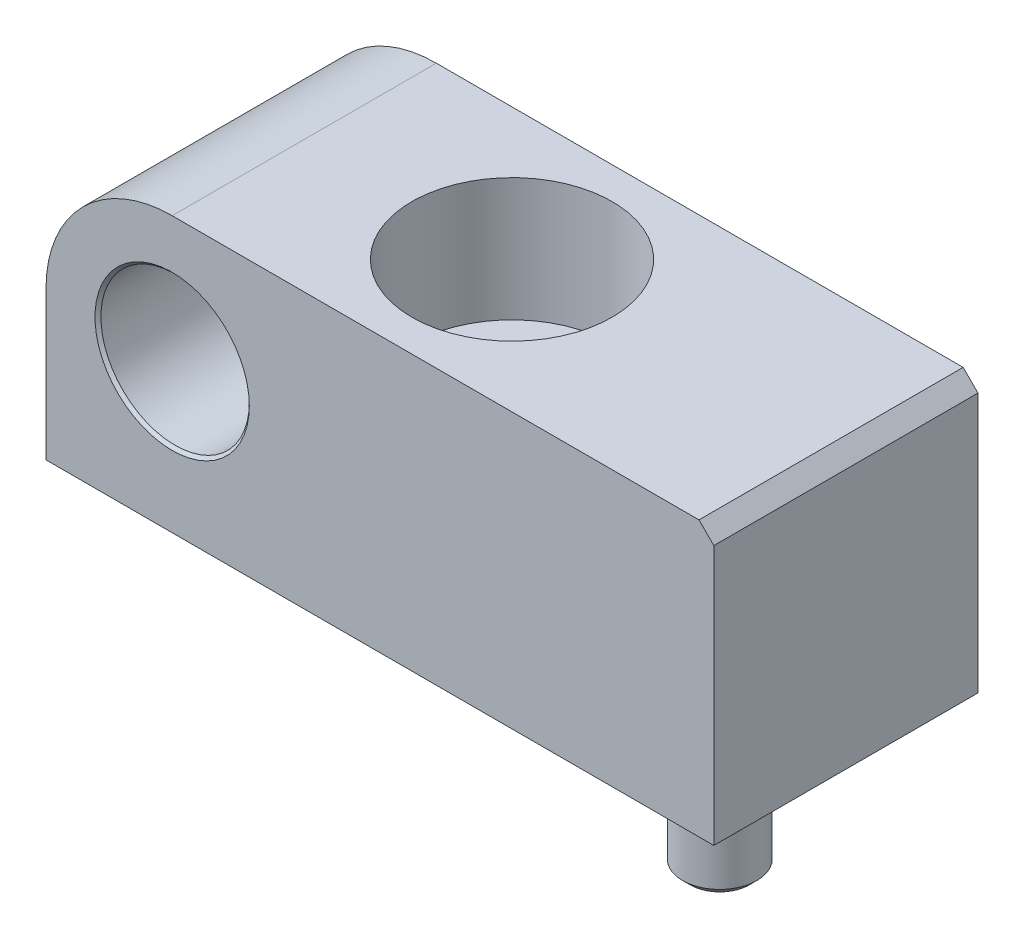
ISO-10303-21;
HEADER;
FILE_DESCRIPTION(('STEP AP214'),'2;1');
FILE_NAME('part.step','',(''),(''),'','','');
FILE_SCHEMA(('AUTOMOTIVE_DESIGN { 1 0 10303 214 1 1 1 1 }'));
ENDSEC;
DATA;
#1=APPLICATION_CONTEXT('core data for automotive mechanical design processes');
#2=APPLICATION_PROTOCOL_DEFINITION('international standard','automotive_design',2000,#1);
#3=PRODUCT_CONTEXT('',#1,'mechanical');
#4=PRODUCT('Part','Part','',(#3));
#5=PRODUCT_RELATED_PRODUCT_CATEGORY('part','',(#4));
#6=PRODUCT_DEFINITION_FORMATION('','',#4);
#7=PRODUCT_DEFINITION_CONTEXT('part definition',#1,'design');
#8=PRODUCT_DEFINITION('design','',#6,#7);
#9=PRODUCT_DEFINITION_SHAPE('','',#8);
#10=(LENGTH_UNIT() NAMED_UNIT(*) SI_UNIT(.MILLI.,.METRE.));
#11=(NAMED_UNIT(*) PLANE_ANGLE_UNIT() SI_UNIT($,.RADIAN.));
#12=(NAMED_UNIT(*) SI_UNIT($,.STERADIAN.) SOLID_ANGLE_UNIT());
#13=UNCERTAINTY_MEASURE_WITH_UNIT(LENGTH_MEASURE(1.E-05),#10,'distance_accuracy_value','');
#14=(GEOMETRIC_REPRESENTATION_CONTEXT(3) GLOBAL_UNCERTAINTY_ASSIGNED_CONTEXT((#13)) GLOBAL_UNIT_ASSIGNED_CONTEXT((#10,
#11,#12)) REPRESENTATION_CONTEXT('',''));
#15=CARTESIAN_POINT('',(0.,0.,0.));
#16=DIRECTION('',(0.,0.,1.));
#17=DIRECTION('',(1.,0.,0.));
#18=AXIS2_PLACEMENT_3D('',#15,#16,#17);
#19=CARTESIAN_POINT('',(0.,10.,0.));
#20=DIRECTION('',(0.,-1.,0.));
#21=DIRECTION('',(0.,0.,-1.));
#22=AXIS2_PLACEMENT_3D('',#19,#20,#21);
#23=PLANE('',#22);
#24=CARTESIAN_POINT('',(0.,10.,0.));
#25=DIRECTION('',(0.,-1.,0.));
#26=DIRECTION('',(0.,0.,-1.));
#27=AXIS2_PLACEMENT_3D('',#24,#25,#26);
#28=CIRCLE('',#27,2.5);
#29=CARTESIAN_POINT('',(0.,10.,-2.5));
#30=VERTEX_POINT('',#29);
#31=EDGE_CURVE('P0_E165',#30,#30,#28,.T.);
#32=ORIENTED_EDGE('',*,*,#31,.T.);
#33=EDGE_LOOP('',(#32));
#34=FACE_BOUND('',#33,.T.);
#35=ADVANCED_FACE('P0_F16',(#34),#23,.T.);
#36=CARTESIAN_POINT('',(-13.9999765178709,10.1999962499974,0.));
#37=DIRECTION('',(0.,1.,0.));
#38=DIRECTION('',(0.,0.,1.));
#39=AXIS2_PLACEMENT_3D('',#36,#37,#38);
#40=PLANE('',#39);
#41=CARTESIAN_POINT('',(-13.9999765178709,10.1999962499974,0.));
#42=DIRECTION('',(0.,1.,0.));
#43=DIRECTION('',(0.,0.,1.));
#44=AXIS2_PLACEMENT_3D('',#41,#42,#43);
#45=CIRCLE('',#44,6.75);
#46=CARTESIAN_POINT('',(-13.9999765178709,10.1999962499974,6.75));
#47=VERTEX_POINT('',#46);
#48=EDGE_CURVE('P0_E19',#47,#47,#45,.T.);
#49=ORIENTED_EDGE('',*,*,#48,.T.);
#50=EDGE_LOOP('',(#49));
#51=FACE_BOUND('',#50,.T.);
#52=CARTESIAN_POINT('',(-13.9999765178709,10.1999962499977,0.));
#53=DIRECTION('',(0.,1.,0.));
#54=DIRECTION('',(0.,0.,1.));
#55=AXIS2_PLACEMENT_3D('',#52,#53,#54);
#56=CIRCLE('',#55,4.2);
#57=CARTESIAN_POINT('',(-13.9999765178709,10.1999962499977,4.2));
#58=VERTEX_POINT('',#57);
#59=EDGE_CURVE('P0_E163',#58,#58,#56,.F.);
#60=ORIENTED_EDGE('',*,*,#59,.T.);
#61=EDGE_LOOP('',(#60));
#62=FACE_BOUND('',#61,.T.);
#63=ADVANCED_FACE('P0_F172',(#51,#62),#40,.T.);
#64=CARTESIAN_POINT('',(-28.,9.99999999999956,-8.89999999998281));
#65=DIRECTION('',(0.,0.,-1.));
#66=DIRECTION('',(-1.,0.,0.));
#67=AXIS2_PLACEMENT_3D('',#64,#65,#66);
#68=CONICAL_SURFACE('',#67,5.19999999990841,0.785398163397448);
#69=CARTESIAN_POINT('',(-28.,9.99999999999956,-8.70000000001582));
#70=DIRECTION('',(0.,0.,1.));
#71=DIRECTION('',(1.,0.,0.));
#72=AXIS2_PLACEMENT_3D('',#69,#70,#71);
#73=CIRCLE('',#72,5.);
#74=CARTESIAN_POINT('',(-23.,9.99999999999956,-8.70000000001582));
#75=VERTEX_POINT('',#74);
#76=EDGE_CURVE('P0_E147',#75,#75,#73,.T.);
#77=ORIENTED_EDGE('',*,*,#76,.T.);
#78=EDGE_LOOP('',(#77));
#79=FACE_BOUND('',#78,.T.);
#80=CARTESIAN_POINT('',(-28.,9.99999999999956,-8.90000000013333));
#81=DIRECTION('',(0.,0.,-1.));
#82=DIRECTION('',(-1.,0.,0.));
#83=AXIS2_PLACEMENT_3D('',#80,#81,#82);
#84=CIRCLE('',#83,5.20000000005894);
#85=CARTESIAN_POINT('',(-33.2000000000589,9.99999999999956,-8.90000000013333));
#86=VERTEX_POINT('',#85);
#87=EDGE_CURVE('P0_E125',#86,#86,#84,.T.);
#88=ORIENTED_EDGE('',*,*,#87,.T.);
#89=EDGE_LOOP('',(#88));
#90=FACE_BOUND('',#89,.T.);
#91=ADVANCED_FACE('P0_F307',(#79,#90),#68,.F.);
#92=CARTESIAN_POINT('',(-28.,9.99999999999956,-8.9));
#93=DIRECTION('',(0.,0.,1.));
#94=DIRECTION('',(1.,0.,0.));
#95=AXIS2_PLACEMENT_3D('',#92,#93,#94);
#96=CYLINDRICAL_SURFACE('',#95,5.);
#97=ORIENTED_EDGE('',*,*,#76,.F.);
#98=EDGE_LOOP('',(#97));
#99=FACE_BOUND('',#98,.T.);
#100=CARTESIAN_POINT('',(-28.,9.99999999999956,8.69999999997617));
#101=DIRECTION('',(0.,0.,1.));
#102=DIRECTION('',(1.,0.,0.));
#103=AXIS2_PLACEMENT_3D('',#100,#101,#102);
#104=CIRCLE('',#103,5.00000000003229);
#105=CARTESIAN_POINT('',(-22.9999999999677,9.99999999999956,8.69999999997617));
#106=VERTEX_POINT('',#105);
#107=EDGE_CURVE('P0_E129',#106,#106,#104,.T.);
#108=ORIENTED_EDGE('',*,*,#107,.T.);
#109=EDGE_LOOP('',(#108));
#110=FACE_BOUND('',#109,.T.);
#111=ADVANCED_FACE('P0_F179',(#99,#110),#96,.F.);
#112=CARTESIAN_POINT('',(-13.9999765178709,10.1999962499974,0.));
#113=DIRECTION('',(0.,1.,0.));
#114=DIRECTION('',(0.,0.,1.));
#115=AXIS2_PLACEMENT_3D('',#112,#113,#114);
#116=CYLINDRICAL_SURFACE('',#115,6.75);
#117=ORIENTED_EDGE('',*,*,#48,.F.);
#118=EDGE_LOOP('',(#117));
#119=FACE_BOUND('',#118,.T.);
#120=CARTESIAN_POINT('',(-13.9999765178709,18.4999962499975,0.));
#121=DIRECTION('',(0.,1.,0.));
#122=DIRECTION('',(0.,0.,1.));
#123=AXIS2_PLACEMENT_3D('',#120,#121,#122);
#124=CIRCLE('',#123,6.75);
#125=CARTESIAN_POINT('',(-13.9999765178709,18.4999962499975,6.75));
#126=VERTEX_POINT('',#125);
#127=EDGE_CURVE('P0_E111',#126,#126,#124,.F.);
#128=ORIENTED_EDGE('',*,*,#127,.F.);
#129=EDGE_LOOP('',(#128));
#130=FACE_BOUND('',#129,.T.);
#131=ADVANCED_FACE('P0_F175',(#119,#130),#116,.F.);
#132=CARTESIAN_POINT('',(0.,10.,0.));
#133=DIRECTION('',(0.,-1.,0.));
#134=DIRECTION('',(0.,0.,-1.));
#135=AXIS2_PLACEMENT_3D('',#132,#133,#134);
#136=CYLINDRICAL_SURFACE('',#135,2.5);
#137=ORIENTED_EDGE('',*,*,#31,.F.);
#138=EDGE_LOOP('',(#137));
#139=FACE_BOUND('',#138,.T.);
#140=CARTESIAN_POINT('',(0.,0.,0.));
#141=DIRECTION('',(0.,-1.,0.));
#142=DIRECTION('',(0.,0.,-1.));
#143=AXIS2_PLACEMENT_3D('',#140,#141,#142);
#144=CIRCLE('',#143,2.5);
#145=CARTESIAN_POINT('',(0.,0.,-2.5));
#146=VERTEX_POINT('',#145);
#147=EDGE_CURVE('P0_E89',#146,#146,#144,.F.);
#148=ORIENTED_EDGE('',*,*,#147,.F.);
#149=EDGE_LOOP('',(#148));
#150=FACE_BOUND('',#149,.T.);
#151=ADVANCED_FACE('P0_F178',(#139,#150),#136,.F.);
#152=CARTESIAN_POINT('',(-13.9999765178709,0.,0.));
#153=DIRECTION('',(0.,1.,0.));
#154=DIRECTION('',(0.,0.,1.));
#155=AXIS2_PLACEMENT_3D('',#152,#153,#154);
#156=CYLINDRICAL_SURFACE('',#155,4.2);
#157=ORIENTED_EDGE('',*,*,#59,.F.);
#158=EDGE_LOOP('',(#157));
#159=FACE_BOUND('',#158,.T.);
#160=CARTESIAN_POINT('',(-13.9999765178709,0.,0.));
#161=DIRECTION('',(0.,1.,0.));
#162=DIRECTION('',(0.,0.,1.));
#163=AXIS2_PLACEMENT_3D('',#160,#161,#162);
#164=CIRCLE('',#163,4.2);
#165=CARTESIAN_POINT('',(-13.9999765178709,0.,4.2));
#166=VERTEX_POINT('',#165);
#167=EDGE_CURVE('P0_E105',#166,#166,#164,.T.);
#168=ORIENTED_EDGE('',*,*,#167,.F.);
#169=EDGE_LOOP('',(#168));
#170=FACE_BOUND('',#169,.T.);
#171=ADVANCED_FACE('P0_F273',(#159,#170),#156,.F.);
#172=CARTESIAN_POINT('',(-28.,9.99999999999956,-8.9));
#173=DIRECTION('',(0.,0.,1.));
#174=DIRECTION('',(1.,0.,0.));
#175=AXIS2_PLACEMENT_3D('',#172,#173,#174);
#176=PLANE('',#175);
#177=DIRECTION('',(1.,0.,0.));
#178=VECTOR('',#177,1.);
#179=CARTESIAN_POINT('',(-28.,18.4999962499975,-8.9));
#180=LINE('',#179,#178);
#181=CARTESIAN_POINT('',(7.50002348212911,18.4999962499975,-8.9));
#182=VERTEX_POINT('',#181);
#183=CARTESIAN_POINT('',(-28.,18.4999962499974,-8.9));
#184=VERTEX_POINT('',#183);
#185=EDGE_CURVE('P0_E66',#182,#184,#180,.F.);
#186=ORIENTED_EDGE('',*,*,#185,.F.);
#187=DIRECTION('',(-0.707106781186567,0.707106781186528,0.));
#188=VECTOR('',#187,1.);
#189=CARTESIAN_POINT('',(7.50002348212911,18.4999962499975,-8.9));
#190=LINE('',#189,#188);
#191=CARTESIAN_POINT('',(8.50002348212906,17.4999962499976,-8.9));
#192=VERTEX_POINT('',#191);
#193=EDGE_CURVE('P0_E124',#192,#182,#190,.T.);
#194=ORIENTED_EDGE('',*,*,#193,.F.);
#195=DIRECTION('',(0.,1.,0.));
#196=VECTOR('',#195,1.);
#197=CARTESIAN_POINT('',(8.50002348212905,0.,-8.9));
#198=LINE('',#197,#196);
#199=CARTESIAN_POINT('',(8.50002348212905,0.,-8.9));
#200=VERTEX_POINT('',#199);
#201=EDGE_CURVE('P0_E138',#200,#192,#198,.T.);
#202=ORIENTED_EDGE('',*,*,#201,.F.);
#203=DIRECTION('',(1.,0.,0.));
#204=VECTOR('',#203,1.);
#205=CARTESIAN_POINT('',(8.50002348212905,0.,-8.9));
#206=LINE('',#205,#204);
#207=CARTESIAN_POINT('',(-36.4999962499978,0.,-8.9));
#208=VERTEX_POINT('',#207);
#209=EDGE_CURVE('P0_E86',#208,#200,#206,.T.);
#210=ORIENTED_EDGE('',*,*,#209,.F.);
#211=DIRECTION('',(0.,1.,0.));
#212=VECTOR('',#211,1.);
#213=CARTESIAN_POINT('',(-36.4999962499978,0.,-8.9));
#214=LINE('',#213,#212);
#215=CARTESIAN_POINT('',(-36.4999962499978,9.99999999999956,-8.9));
#216=VERTEX_POINT('',#215);
#217=EDGE_CURVE('P0_E82',#216,#208,#214,.F.);
#218=ORIENTED_EDGE('',*,*,#217,.F.);
#219=CARTESIAN_POINT('',(-28.,9.99999999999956,-8.9));
#220=DIRECTION('',(0.,0.,1.));
#221=DIRECTION('',(1.,0.,0.));
#222=AXIS2_PLACEMENT_3D('',#219,#220,#221);
#223=CIRCLE('',#222,8.49999624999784);
#224=EDGE_CURVE('P0_E71',#184,#216,#223,.T.);
#225=ORIENTED_EDGE('',*,*,#224,.F.);
#226=EDGE_LOOP('',(#186,#194,#202,#210,#218,#225));
#227=FACE_BOUND('',#226,.T.);
#228=ORIENTED_EDGE('',*,*,#87,.F.);
#229=EDGE_LOOP('',(#228));
#230=FACE_BOUND('',#229,.T.);
#231=ADVANCED_FACE('P0_F83',(#227,#230),#176,.F.);
#232=CARTESIAN_POINT('',(7.50002348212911,18.4999962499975,-8.9));
#233=DIRECTION('',(0.707106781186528,0.707106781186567,0.));
#234=DIRECTION('',(-0.707106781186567,0.707106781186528,0.));
#235=AXIS2_PLACEMENT_3D('',#232,#233,#234);
#236=PLANE('',#235);
#237=ORIENTED_EDGE('',*,*,#193,.T.);
#238=DIRECTION('',(0.,0.,1.));
#239=VECTOR('',#238,1.);
#240=CARTESIAN_POINT('',(7.50002348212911,18.4999962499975,-8.9));
#241=LINE('',#240,#239);
#242=CARTESIAN_POINT('',(7.50002348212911,18.4999962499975,8.9));
#243=VERTEX_POINT('',#242);
#244=EDGE_CURVE('P0_E109',#243,#182,#241,.F.);
#245=ORIENTED_EDGE('',*,*,#244,.F.);
#246=DIRECTION('',(-0.707106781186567,0.707106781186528,0.));
#247=VECTOR('',#246,1.);
#248=CARTESIAN_POINT('',(7.50002348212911,18.4999962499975,8.9));
#249=LINE('',#248,#247);
#250=CARTESIAN_POINT('',(8.50002348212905,17.4999962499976,8.9));
#251=VERTEX_POINT('',#250);
#252=EDGE_CURVE('P0_E122',#243,#251,#249,.F.);
#253=ORIENTED_EDGE('',*,*,#252,.T.);
#254=DIRECTION('',(0.,0.,-1.));
#255=VECTOR('',#254,1.);
#256=CARTESIAN_POINT('',(8.50002348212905,17.4999962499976,-8.9));
#257=LINE('',#256,#255);
#258=EDGE_CURVE('P0_E134',#192,#251,#257,.F.);
#259=ORIENTED_EDGE('',*,*,#258,.F.);
#260=EDGE_LOOP('',(#237,#245,#253,#259));
#261=FACE_BOUND('',#260,.T.);
#262=ADVANCED_FACE('P0_F193',(#261),#236,.T.);
#263=CARTESIAN_POINT('',(-28.,9.99999999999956,8.89999999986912));
#264=DIRECTION('',(0.,0.,1.));
#265=DIRECTION('',(1.,0.,0.));
#266=AXIS2_PLACEMENT_3D('',#263,#264,#265);
#267=CONICAL_SURFACE('',#266,5.19999999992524,0.785398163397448);
#268=ORIENTED_EDGE('',*,*,#107,.F.);
#269=EDGE_LOOP('',(#268));
#270=FACE_BOUND('',#269,.T.);
#271=CARTESIAN_POINT('',(-28.,9.99999999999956,8.89999999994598));
#272=DIRECTION('',(0.,0.,1.));
#273=DIRECTION('',(1.,0.,0.));
#274=AXIS2_PLACEMENT_3D('',#271,#272,#273);
#275=CIRCLE('',#274,5.20000000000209);
#276=CARTESIAN_POINT('',(-22.7999999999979,9.99999999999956,8.89999999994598));
#277=VERTEX_POINT('',#276);
#278=EDGE_CURVE('P0_E137',#277,#277,#275,.F.);
#279=ORIENTED_EDGE('',*,*,#278,.F.);
#280=EDGE_LOOP('',(#279));
#281=FACE_BOUND('',#280,.T.);
#282=ADVANCED_FACE('P0_F185',(#270,#281),#267,.F.);
#283=CARTESIAN_POINT('',(-28.,18.4999962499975,-8.9));
#284=DIRECTION('',(0.,1.,0.));
#285=DIRECTION('',(0.,0.,1.));
#286=AXIS2_PLACEMENT_3D('',#283,#284,#285);
#287=PLANE('',#286);
#288=ORIENTED_EDGE('',*,*,#185,.T.);
#289=DIRECTION('',(0.,0.,1.));
#290=VECTOR('',#289,1.);
#291=CARTESIAN_POINT('',(-28.,18.4999962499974,-8.9));
#292=LINE('',#291,#290);
#293=CARTESIAN_POINT('',(-28.,18.4999962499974,8.9));
#294=VERTEX_POINT('',#293);
#295=EDGE_CURVE('P0_E78',#294,#184,#292,.F.);
#296=ORIENTED_EDGE('',*,*,#295,.F.);
#297=DIRECTION('',(1.,0.,0.));
#298=VECTOR('',#297,1.);
#299=CARTESIAN_POINT('',(-28.,18.4999962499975,8.9));
#300=LINE('',#299,#298);
#301=EDGE_CURVE('P0_E152',#243,#294,#300,.F.);
#302=ORIENTED_EDGE('',*,*,#301,.F.);
#303=ORIENTED_EDGE('',*,*,#244,.T.);
#304=EDGE_LOOP('',(#288,#296,#302,#303));
#305=FACE_BOUND('',#304,.T.);
#306=ORIENTED_EDGE('',*,*,#127,.T.);
#307=EDGE_LOOP('',(#306));
#308=FACE_BOUND('',#307,.T.);
#309=ADVANCED_FACE('P0_F183',(#305,#308),#287,.T.);
#310=CARTESIAN_POINT('',(-28.,9.99999999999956,-8.9));
#311=DIRECTION('',(0.,0.,1.));
#312=DIRECTION('',(1.,0.,0.));
#313=AXIS2_PLACEMENT_3D('',#310,#311,#312);
#314=CYLINDRICAL_SURFACE('',#313,8.49999624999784);
#315=ORIENTED_EDGE('',*,*,#224,.T.);
#316=DIRECTION('',(0.,0.,1.));
#317=VECTOR('',#316,1.);
#318=CARTESIAN_POINT('',(-36.4999962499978,9.99999999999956,-8.9));
#319=LINE('',#318,#317);
#320=CARTESIAN_POINT('',(-36.4999962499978,9.99999999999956,8.9));
#321=VERTEX_POINT('',#320);
#322=EDGE_CURVE('P0_E76',#321,#216,#319,.F.);
#323=ORIENTED_EDGE('',*,*,#322,.F.);
#324=CARTESIAN_POINT('',(-28.,9.99999999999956,8.9));
#325=DIRECTION('',(0.,0.,1.));
#326=DIRECTION('',(1.,0.,0.));
#327=AXIS2_PLACEMENT_3D('',#324,#325,#326);
#328=CIRCLE('',#327,8.49999624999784);
#329=EDGE_CURVE('P0_E150',#294,#321,#328,.T.);
#330=ORIENTED_EDGE('',*,*,#329,.F.);
#331=ORIENTED_EDGE('',*,*,#295,.T.);
#332=EDGE_LOOP('',(#315,#323,#330,#331));
#333=FACE_BOUND('',#332,.T.);
#334=ADVANCED_FACE('P0_F73',(#333),#314,.T.);
#335=CARTESIAN_POINT('',(-36.4999962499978,0.,-8.9));
#336=DIRECTION('',(-1.,0.,0.));
#337=DIRECTION('',(0.,0.,1.));
#338=AXIS2_PLACEMENT_3D('',#335,#336,#337);
#339=PLANE('',#338);
#340=ORIENTED_EDGE('',*,*,#217,.T.);
#341=DIRECTION('',(0.,0.,-1.));
#342=VECTOR('',#341,1.);
#343=CARTESIAN_POINT('',(-36.4999962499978,0.,-8.9));
#344=LINE('',#343,#342);
#345=CARTESIAN_POINT('',(-36.4999962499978,0.,8.9));
#346=VERTEX_POINT('',#345);
#347=EDGE_CURVE('P0_E103',#346,#208,#344,.T.);
#348=ORIENTED_EDGE('',*,*,#347,.F.);
#349=DIRECTION('',(0.,1.,0.));
#350=VECTOR('',#349,1.);
#351=CARTESIAN_POINT('',(-36.4999962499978,9.99999999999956,8.9));
#352=LINE('',#351,#350);
#353=EDGE_CURVE('P0_E93',#321,#346,#352,.F.);
#354=ORIENTED_EDGE('',*,*,#353,.F.);
#355=ORIENTED_EDGE('',*,*,#322,.T.);
#356=EDGE_LOOP('',(#340,#348,#354,#355));
#357=FACE_BOUND('',#356,.T.);
#358=ADVANCED_FACE('P0_F91',(#357),#339,.T.);
#359=CARTESIAN_POINT('',(8.50002348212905,0.,-8.9));
#360=DIRECTION('',(0.,-1.,0.));
#361=DIRECTION('',(0.,0.,-1.));
#362=AXIS2_PLACEMENT_3D('',#359,#360,#361);
#363=PLANE('',#362);
#364=ORIENTED_EDGE('',*,*,#209,.T.);
#365=DIRECTION('',(0.,0.,-1.));
#366=VECTOR('',#365,1.);
#367=CARTESIAN_POINT('',(8.50002348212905,0.,-8.9));
#368=LINE('',#367,#366);
#369=CARTESIAN_POINT('',(8.50002348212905,0.,8.9));
#370=VERTEX_POINT('',#369);
#371=EDGE_CURVE('P0_E34',#370,#200,#368,.T.);
#372=ORIENTED_EDGE('',*,*,#371,.F.);
#373=DIRECTION('',(1.,0.,0.));
#374=VECTOR('',#373,1.);
#375=CARTESIAN_POINT('',(-28.,0.,8.9));
#376=LINE('',#375,#374);
#377=EDGE_CURVE('P0_E25',#346,#370,#376,.T.);
#378=ORIENTED_EDGE('',*,*,#377,.F.);
#379=ORIENTED_EDGE('',*,*,#347,.T.);
#380=EDGE_LOOP('',(#364,#372,#378,#379));
#381=FACE_BOUND('',#380,.T.);
#382=ORIENTED_EDGE('',*,*,#167,.T.);
#383=EDGE_LOOP('',(#382));
#384=FACE_BOUND('',#383,.T.);
#385=ORIENTED_EDGE('',*,*,#147,.T.);
#386=EDGE_LOOP('',(#385));
#387=FACE_BOUND('',#386,.T.);
#388=ADVANCED_FACE('P0_F204',(#381,#384,#387),#363,.T.);
#389=CARTESIAN_POINT('',(8.50002348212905,0.,-8.9));
#390=DIRECTION('',(1.,0.,0.));
#391=DIRECTION('',(0.,0.,-1.));
#392=AXIS2_PLACEMENT_3D('',#389,#390,#391);
#393=PLANE('',#392);
#394=ORIENTED_EDGE('',*,*,#201,.T.);
#395=ORIENTED_EDGE('',*,*,#258,.T.);
#396=DIRECTION('',(0.,1.,0.));
#397=VECTOR('',#396,1.);
#398=CARTESIAN_POINT('',(8.50002348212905,9.99999999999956,8.9));
#399=LINE('',#398,#397);
#400=EDGE_CURVE('P0_E11',#370,#251,#399,.T.);
#401=ORIENTED_EDGE('',*,*,#400,.F.);
#402=ORIENTED_EDGE('',*,*,#371,.T.);
#403=EDGE_LOOP('',(#394,#395,#401,#402));
#404=FACE_BOUND('',#403,.T.);
#405=ADVANCED_FACE('P0_F198',(#404),#393,.T.);
#406=CARTESIAN_POINT('',(-28.,9.99999999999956,8.9));
#407=DIRECTION('',(0.,0.,1.));
#408=DIRECTION('',(1.,0.,0.));
#409=AXIS2_PLACEMENT_3D('',#406,#407,#408);
#410=PLANE('',#409);
#411=ORIENTED_EDGE('',*,*,#377,.T.);
#412=ORIENTED_EDGE('',*,*,#400,.T.);
#413=ORIENTED_EDGE('',*,*,#252,.F.);
#414=ORIENTED_EDGE('',*,*,#301,.T.);
#415=ORIENTED_EDGE('',*,*,#329,.T.);
#416=ORIENTED_EDGE('',*,*,#353,.T.);
#417=EDGE_LOOP('',(#411,#412,#413,#414,#415,#416));
#418=FACE_BOUND('',#417,.T.);
#419=ORIENTED_EDGE('',*,*,#278,.T.);
#420=EDGE_LOOP('',(#419));
#421=FACE_BOUND('',#420,.T.);
#422=ADVANCED_FACE('P0_F196',(#418,#421),#410,.T.);
#423=CLOSED_SHELL('',(#35,#63,#91,#111,#131,#151,#171,#231,#262,#282,#309,#334,#358,#388,#405,#422));
#424=MANIFOLD_SOLID_BREP('P0_B1',#423);
#425=CARTESIAN_POINT('',(-1.73356449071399,-10.,0.));
#426=DIRECTION('',(0.,-1.,0.));
#427=DIRECTION('',(0.,0.,-1.));
#428=AXIS2_PLACEMENT_3D('',#425,#426,#427);
#429=PLANE('',#428);
#430=CARTESIAN_POINT('',(0.,-9.99999999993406,0.));
#431=DIRECTION('',(0.,1.,0.));
#432=DIRECTION('',(0.,0.,1.));
#433=AXIS2_PLACEMENT_3D('',#430,#431,#432);
#434=CIRCLE('',#433,2.00000000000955);
#435=CARTESIAN_POINT('',(0.,-9.99999999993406,2.00000000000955));
#436=VERTEX_POINT('',#435);
#437=EDGE_CURVE('P1_E40',#436,#436,#434,.T.);
#438=ORIENTED_EDGE('',*,*,#437,.F.);
#439=EDGE_LOOP('',(#438));
#440=FACE_BOUND('',#439,.T.);
#441=ADVANCED_FACE('P1_F15',(#440),#429,.T.);
#442=CARTESIAN_POINT('',(0.,10.,0.));
#443=DIRECTION('',(0.,1.,0.));
#444=DIRECTION('',(0.,0.,1.));
#445=AXIS2_PLACEMENT_3D('',#442,#443,#444);
#446=PLANE('',#445);
#447=CARTESIAN_POINT('',(0.,10.,0.));
#448=DIRECTION('',(0.,-1.,0.));
#449=DIRECTION('',(0.,0.,-1.));
#450=AXIS2_PLACEMENT_3D('',#447,#448,#449);
#451=CIRCLE('',#450,1.74716881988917);
#452=CARTESIAN_POINT('',(0.,10.,-1.74716881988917));
#453=VERTEX_POINT('',#452);
#454=CARTESIAN_POINT('',(0.,10.,1.74716881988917));
#455=VERTEX_POINT('',#454);
#456=EDGE_CURVE('P1_E38',#453,#455,#451,.T.);
#457=ORIENTED_EDGE('',*,*,#456,.F.);
#458=CARTESIAN_POINT('',(0.,10.,0.));
#459=DIRECTION('',(0.,-1.,0.));
#460=DIRECTION('',(0.,0.,1.));
#461=AXIS2_PLACEMENT_3D('',#458,#459,#460);
#462=CIRCLE('',#461,1.74716881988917);
#463=EDGE_CURVE('P1_E32',#455,#453,#462,.T.);
#464=ORIENTED_EDGE('',*,*,#463,.F.);
#465=EDGE_LOOP('',(#457,#464));
#466=FACE_BOUND('',#465,.T.);
#467=ADVANCED_FACE('P1_F43',(#466),#446,.T.);
#468=CARTESIAN_POINT('',(0.,-9.50000000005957,0.));
#469=DIRECTION('',(0.,1.,0.));
#470=DIRECTION('',(0.,0.,1.));
#471=AXIS2_PLACEMENT_3D('',#468,#469,#470);
#472=CONICAL_SURFACE('',#471,2.49999999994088,0.785398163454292);
#473=CARTESIAN_POINT('',(0.,-9.49999999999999,0.));
#474=DIRECTION('',(0.,1.,0.));
#475=DIRECTION('',(0.,0.,1.));
#476=AXIS2_PLACEMENT_3D('',#473,#474,#475);
#477=CIRCLE('',#476,2.5);
#478=CARTESIAN_POINT('',(0.,-9.49999999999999,2.5));
#479=VERTEX_POINT('',#478);
#480=EDGE_CURVE('P1_E25',#479,#479,#477,.T.);
#481=ORIENTED_EDGE('',*,*,#480,.F.);
#482=EDGE_LOOP('',(#481));
#483=FACE_BOUND('',#482,.T.);
#484=ORIENTED_EDGE('',*,*,#437,.T.);
#485=EDGE_LOOP('',(#484));
#486=FACE_BOUND('',#485,.T.);
#487=ADVANCED_FACE('P1_F59',(#483,#486),#472,.T.);
#488=CARTESIAN_POINT('',(0.,9.24716881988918,0.));
#489=DIRECTION('',(0.,1.,0.));
#490=DIRECTION('',(0.,0.,1.));
#491=AXIS2_PLACEMENT_3D('',#488,#489,#490);
#492=TOROIDAL_SURFACE('',#491,1.74716881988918,0.752831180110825);
#493=ORIENTED_EDGE('',*,*,#463,.T.);
#494=ORIENTED_EDGE('',*,*,#456,.T.);
#495=EDGE_LOOP('',(#493,#494));
#496=FACE_BOUND('',#495,.T.);
#497=CARTESIAN_POINT('',(0.,9.24716881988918,0.));
#498=DIRECTION('',(0.,1.,0.));
#499=DIRECTION('',(0.,0.,1.));
#500=AXIS2_PLACEMENT_3D('',#497,#498,#499);
#501=CIRCLE('',#500,2.5);
#502=CARTESIAN_POINT('',(0.,9.24716881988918,2.5));
#503=VERTEX_POINT('',#502);
#504=EDGE_CURVE('P1_E10',#503,#503,#501,.F.);
#505=ORIENTED_EDGE('',*,*,#504,.F.);
#506=EDGE_LOOP('',(#505));
#507=FACE_BOUND('',#506,.T.);
#508=ADVANCED_FACE('P1_F36',(#496,#507),#492,.T.);
#509=CARTESIAN_POINT('',(0.,14.2478798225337,0.));
#510=DIRECTION('',(0.,1.,0.));
#511=DIRECTION('',(0.,0.,1.));
#512=AXIS2_PLACEMENT_3D('',#509,#510,#511);
#513=CYLINDRICAL_SURFACE('',#512,2.5);
#514=ORIENTED_EDGE('',*,*,#504,.T.);
#515=EDGE_LOOP('',(#514));
#516=FACE_BOUND('',#515,.T.);
#517=ORIENTED_EDGE('',*,*,#480,.T.);
#518=EDGE_LOOP('',(#517));
#519=FACE_BOUND('',#518,.T.);
#520=ADVANCED_FACE('P1_F79',(#516,#519),#513,.T.);
#521=CLOSED_SHELL('',(#441,#467,#487,#508,#520));
#522=MANIFOLD_SOLID_BREP('P1_B1',#521);
#523=ADVANCED_BREP_SHAPE_REPRESENTATION('',(#18,#424,#522),#14);
#524=SHAPE_DEFINITION_REPRESENTATION(#9,#523);
ENDSEC;
END-ISO-10303-21;
